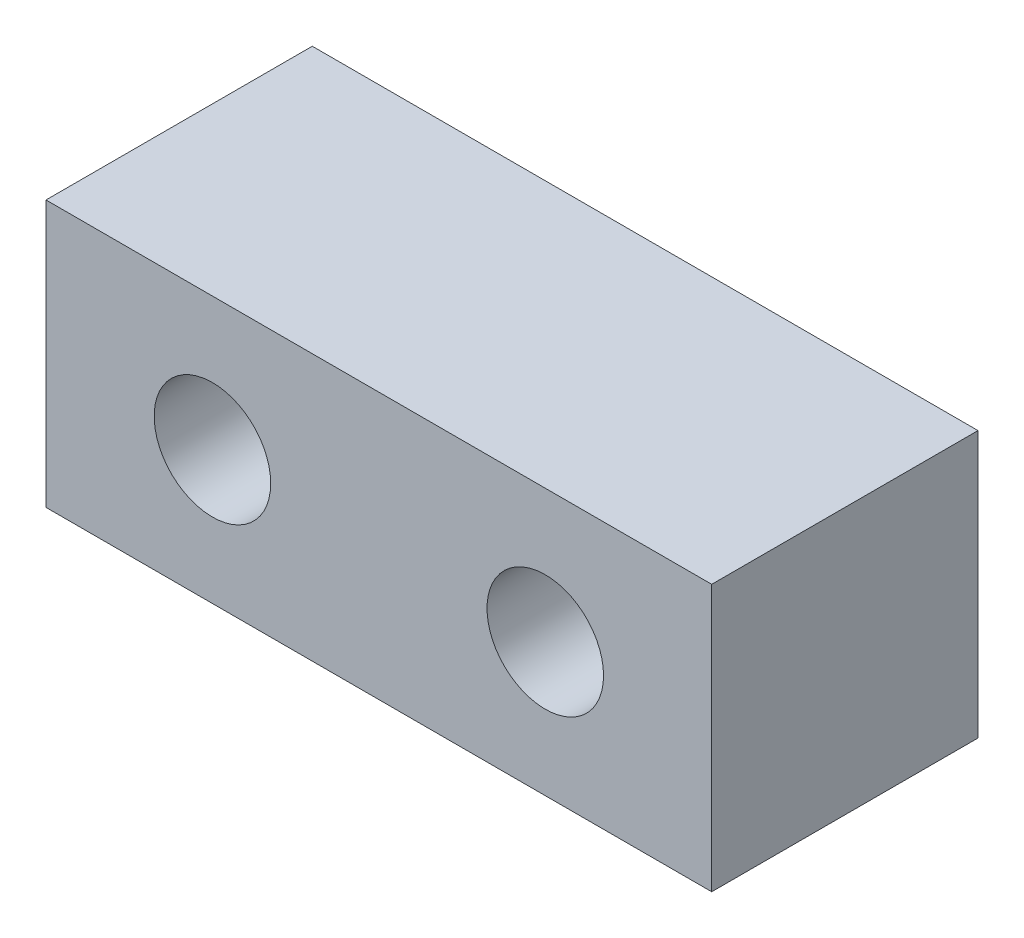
from build123d import *

# Parameters (mm, degrees)
SKETCH1_W                                      = 31.75
SKETCH1_H                                      = 12.7
BOSS_EXTRUDE1_DEPTH                            = 12.7
CBORE_FOR_4_SOCKET_HEAD_CAP_SCREW1_D           = 2.9464
CBORE_FOR_4_SOCKET_HEAD_CAP_SCREW1_CBORE_D     = 5.55752
CBORE_FOR_4_SOCKET_HEAD_CAP_SCREW1_CBORE_DEPTH = 6.35


with BuildPart() as part:
    # Sketch1 → Boss-Extrude1 (new body)
    with BuildSketch(Plane.XY):
        Rectangle(SKETCH1_W, SKETCH1_H)
    extrude(amount=BOSS_EXTRUDE1_DEPTH)

    # CBORE for _4 Socket Head Cap Screw1 (through all)
    with Locations(Plane.XY.offset(12.7)):
        with Locations((-7.9375, 0), (7.9375, 0)):
            CounterBoreHole(CBORE_FOR_4_SOCKET_HEAD_CAP_SCREW1_D / 2, CBORE_FOR_4_SOCKET_HEAD_CAP_SCREW1_CBORE_D / 2, CBORE_FOR_4_SOCKET_HEAD_CAP_SCREW1_CBORE_DEPTH)


solid = part.part
